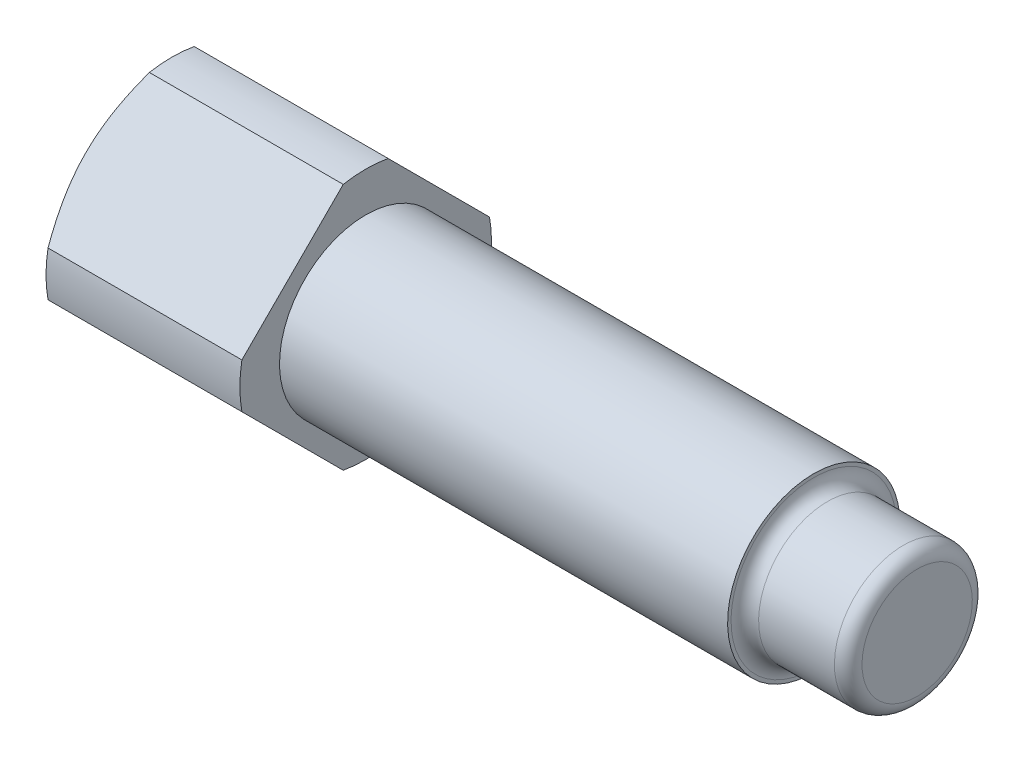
ISO-10303-21;
HEADER;
FILE_DESCRIPTION(('STEP AP214'),'2;1');
FILE_NAME('part.step','',(''),(''),'','','');
FILE_SCHEMA(('AUTOMOTIVE_DESIGN { 1 0 10303 214 1 1 1 1 }'));
ENDSEC;
DATA;
#1=APPLICATION_CONTEXT('core data for automotive mechanical design processes');
#2=APPLICATION_PROTOCOL_DEFINITION('international standard','automotive_design',2000,#1);
#3=PRODUCT_CONTEXT('',#1,'mechanical');
#4=PRODUCT('Part','Part','',(#3));
#5=PRODUCT_RELATED_PRODUCT_CATEGORY('part','',(#4));
#6=PRODUCT_DEFINITION_FORMATION('','',#4);
#7=PRODUCT_DEFINITION_CONTEXT('part definition',#1,'design');
#8=PRODUCT_DEFINITION('design','',#6,#7);
#9=PRODUCT_DEFINITION_SHAPE('','',#8);
#10=(LENGTH_UNIT() NAMED_UNIT(*) SI_UNIT(.MILLI.,.METRE.));
#11=(NAMED_UNIT(*) PLANE_ANGLE_UNIT() SI_UNIT($,.RADIAN.));
#12=(NAMED_UNIT(*) SI_UNIT($,.STERADIAN.) SOLID_ANGLE_UNIT());
#13=UNCERTAINTY_MEASURE_WITH_UNIT(LENGTH_MEASURE(1.E-05),#10,'distance_accuracy_value','');
#14=(GEOMETRIC_REPRESENTATION_CONTEXT(3) GLOBAL_UNCERTAINTY_ASSIGNED_CONTEXT((#13)) GLOBAL_UNIT_ASSIGNED_CONTEXT((#10,
#11,#12)) REPRESENTATION_CONTEXT('',''));
#15=CARTESIAN_POINT('',(0.,0.,0.));
#16=DIRECTION('',(0.,0.,1.));
#17=DIRECTION('',(1.,0.,0.));
#18=AXIS2_PLACEMENT_3D('',#15,#16,#17);
#19=CARTESIAN_POINT('',(6.,0.,0.));
#20=DIRECTION('',(1.,0.,0.));
#21=DIRECTION('',(0.,0.,-1.));
#22=AXIS2_PLACEMENT_3D('',#19,#20,#21);
#23=PLANE('',#22);
#24=CARTESIAN_POINT('',(6.,0.,0.));
#25=DIRECTION('',(1.,0.,0.));
#26=DIRECTION('',(0.,0.,-1.));
#27=AXIS2_PLACEMENT_3D('',#24,#25,#26);
#28=CIRCLE('',#27,3.65);
#29=CARTESIAN_POINT('',(5.99999999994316,0.651201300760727,3.59143938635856));
#30=VERTEX_POINT('',#29);
#31=CARTESIAN_POINT('',(5.99999999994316,-0.651201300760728,3.59143938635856));
#32=VERTEX_POINT('',#31);
#33=EDGE_CURVE('E243',#30,#32,#28,.T.);
#34=ORIENTED_EDGE('',*,*,#33,.T.);
#35=DIRECTION('',(0.,0.707106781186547,0.707106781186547));
#36=VECTOR('',#35,1.);
#37=CARTESIAN_POINT('',(5.99999999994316,-4.24264068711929,0.));
#38=LINE('',#37,#36);
#39=CARTESIAN_POINT('',(5.99999999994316,-3.59143938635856,0.651201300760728));
#40=VERTEX_POINT('',#39);
#41=EDGE_CURVE('E279',#40,#32,#38,.T.);
#42=ORIENTED_EDGE('',*,*,#41,.F.);
#43=CARTESIAN_POINT('',(5.99999999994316,-3.59143938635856,-0.651201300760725));
#44=VERTEX_POINT('',#43);
#45=EDGE_CURVE('E249',#40,#44,#28,.T.);
#46=ORIENTED_EDGE('',*,*,#45,.T.);
#47=DIRECTION('',(0.,-0.707106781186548,0.707106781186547));
#48=VECTOR('',#47,1.);
#49=CARTESIAN_POINT('',(5.99999999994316,0.,-4.24264068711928));
#50=LINE('',#49,#48);
#51=CARTESIAN_POINT('',(5.99999999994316,-0.651201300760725,-3.59143938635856));
#52=VERTEX_POINT('',#51);
#53=EDGE_CURVE('E274',#52,#44,#50,.T.);
#54=ORIENTED_EDGE('',*,*,#53,.F.);
#55=CARTESIAN_POINT('',(5.99999999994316,0.651201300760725,-3.59143938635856));
#56=VERTEX_POINT('',#55);
#57=EDGE_CURVE('E244',#52,#56,#28,.T.);
#58=ORIENTED_EDGE('',*,*,#57,.T.);
#59=DIRECTION('',(0.,-0.707106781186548,-0.707106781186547));
#60=VECTOR('',#59,1.);
#61=CARTESIAN_POINT('',(5.99999999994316,4.24264068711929,0.));
#62=LINE('',#61,#60);
#63=CARTESIAN_POINT('',(5.99999999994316,3.59143938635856,-0.651201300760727));
#64=VERTEX_POINT('',#63);
#65=EDGE_CURVE('E276',#64,#56,#62,.T.);
#66=ORIENTED_EDGE('',*,*,#65,.F.);
#67=CARTESIAN_POINT('',(5.99999999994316,3.59143938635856,0.651201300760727));
#68=VERTEX_POINT('',#67);
#69=EDGE_CURVE('E241',#64,#68,#28,.T.);
#70=ORIENTED_EDGE('',*,*,#69,.T.);
#71=DIRECTION('',(0.,0.707106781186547,-0.707106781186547));
#72=VECTOR('',#71,1.);
#73=CARTESIAN_POINT('',(5.99999999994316,0.,4.24264068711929));
#74=LINE('',#73,#72);
#75=EDGE_CURVE('E278',#30,#68,#74,.T.);
#76=ORIENTED_EDGE('',*,*,#75,.F.);
#77=EDGE_LOOP('',(#34,#42,#46,#54,#58,#66,#70,#76));
#78=FACE_BOUND('',#77,.T.);
#79=CARTESIAN_POINT('',(5.99999999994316,0.,0.));
#80=DIRECTION('',(1.,0.,0.));
#81=DIRECTION('',(0.,1.,0.));
#82=AXIS2_PLACEMENT_3D('',#79,#80,#81);
#83=CIRCLE('',#82,2.5);
#84=CARTESIAN_POINT('',(5.99999999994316,2.5,0.));
#85=VERTEX_POINT('',#84);
#86=EDGE_CURVE('E127',#85,#85,#83,.T.);
#87=ORIENTED_EDGE('',*,*,#86,.F.);
#88=EDGE_LOOP('',(#87));
#89=FACE_BOUND('',#88,.T.);
#90=ADVANCED_FACE('F38',(#78,#89),#23,.T.);
#91=CARTESIAN_POINT('',(6.,0.,0.));
#92=DIRECTION('',(-1.,0.,0.));
#93=DIRECTION('',(0.,0.,1.));
#94=AXIS2_PLACEMENT_3D('',#91,#92,#93);
#95=CYLINDRICAL_SURFACE('',#94,3.65);
#96=DIRECTION('',(-1.,0.,0.));
#97=VECTOR('',#96,1.);
#98=CARTESIAN_POINT('',(6.,0.651201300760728,3.59143938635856));
#99=LINE('',#98,#97);
#100=CARTESIAN_POINT('',(0.375277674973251,0.651201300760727,3.59143938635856));
#101=VERTEX_POINT('',#100);
#102=EDGE_CURVE('E272',#101,#30,#99,.F.);
#103=ORIENTED_EDGE('',*,*,#102,.F.);
#104=CARTESIAN_POINT('',(0.375277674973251,0.,0.));
#105=DIRECTION('',(1.,0.,0.));
#106=DIRECTION('',(0.,1.,0.));
#107=AXIS2_PLACEMENT_3D('',#104,#105,#106);
#108=CIRCLE('',#107,3.65);
#109=CARTESIAN_POINT('',(0.375277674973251,-0.651201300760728,3.59143938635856));
#110=VERTEX_POINT('',#109);
#111=EDGE_CURVE('E136',#101,#110,#108,.T.);
#112=ORIENTED_EDGE('',*,*,#111,.T.);
#113=DIRECTION('',(-1.,0.,0.));
#114=VECTOR('',#113,1.);
#115=CARTESIAN_POINT('',(6.,-0.651201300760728,3.59143938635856));
#116=LINE('',#115,#114);
#117=EDGE_CURVE('E252',#32,#110,#116,.T.);
#118=ORIENTED_EDGE('',*,*,#117,.F.);
#119=ORIENTED_EDGE('',*,*,#33,.F.);
#120=EDGE_LOOP('',(#103,#112,#118,#119));
#121=FACE_BOUND('',#120,.T.);
#122=ADVANCED_FACE('F210',(#121),#95,.T.);
#123=DIRECTION('',(-1.,0.,0.));
#124=VECTOR('',#123,1.);
#125=CARTESIAN_POINT('',(6.,-3.59143938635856,0.651201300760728));
#126=LINE('',#125,#124);
#127=CARTESIAN_POINT('',(0.375277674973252,-3.59143938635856,0.651201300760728));
#128=VERTEX_POINT('',#127);
#129=EDGE_CURVE('E257',#128,#40,#126,.F.);
#130=ORIENTED_EDGE('',*,*,#129,.F.);
#131=CARTESIAN_POINT('',(0.375277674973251,0.,0.));
#132=DIRECTION('',(1.,0.,0.));
#133=DIRECTION('',(0.,1.,0.));
#134=AXIS2_PLACEMENT_3D('',#131,#132,#133);
#135=CIRCLE('',#134,3.65);
#136=CARTESIAN_POINT('',(0.375277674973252,-3.59143938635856,-0.651201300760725));
#137=VERTEX_POINT('',#136);
#138=EDGE_CURVE('E150',#128,#137,#135,.T.);
#139=ORIENTED_EDGE('',*,*,#138,.T.);
#140=DIRECTION('',(-1.,0.,0.));
#141=VECTOR('',#140,1.);
#142=CARTESIAN_POINT('',(6.,-3.59143938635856,-0.651201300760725));
#143=LINE('',#142,#141);
#144=EDGE_CURVE('E259',#44,#137,#143,.T.);
#145=ORIENTED_EDGE('',*,*,#144,.F.);
#146=ORIENTED_EDGE('',*,*,#45,.F.);
#147=EDGE_LOOP('',(#130,#139,#145,#146));
#148=FACE_BOUND('',#147,.T.);
#149=ADVANCED_FACE('F215',(#148),#95,.T.);
#150=DIRECTION('',(-1.,0.,0.));
#151=VECTOR('',#150,1.);
#152=CARTESIAN_POINT('',(6.,-0.651201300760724,-3.59143938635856));
#153=LINE('',#152,#151);
#154=CARTESIAN_POINT('',(0.375277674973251,-0.651201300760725,-3.59143938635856));
#155=VERTEX_POINT('',#154);
#156=EDGE_CURVE('E264',#155,#52,#153,.F.);
#157=ORIENTED_EDGE('',*,*,#156,.F.);
#158=CARTESIAN_POINT('',(0.375277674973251,0.,0.));
#159=DIRECTION('',(1.,0.,0.));
#160=DIRECTION('',(0.,1.,0.));
#161=AXIS2_PLACEMENT_3D('',#158,#159,#160);
#162=CIRCLE('',#161,3.65);
#163=CARTESIAN_POINT('',(0.375277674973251,0.651201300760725,-3.59143938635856));
#164=VERTEX_POINT('',#163);
#165=EDGE_CURVE('E139',#155,#164,#162,.T.);
#166=ORIENTED_EDGE('',*,*,#165,.T.);
#167=DIRECTION('',(-1.,0.,0.));
#168=VECTOR('',#167,1.);
#169=CARTESIAN_POINT('',(6.,0.651201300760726,-3.59143938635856));
#170=LINE('',#169,#168);
#171=EDGE_CURVE('E266',#56,#164,#170,.T.);
#172=ORIENTED_EDGE('',*,*,#171,.F.);
#173=ORIENTED_EDGE('',*,*,#57,.F.);
#174=EDGE_LOOP('',(#157,#166,#172,#173));
#175=FACE_BOUND('',#174,.T.);
#176=ADVANCED_FACE('F288',(#175),#95,.T.);
#177=DIRECTION('',(-1.,0.,0.));
#178=VECTOR('',#177,1.);
#179=CARTESIAN_POINT('',(6.,3.59143938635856,-0.651201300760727));
#180=LINE('',#179,#178);
#181=CARTESIAN_POINT('',(0.375277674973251,3.59143938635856,-0.651201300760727));
#182=VERTEX_POINT('',#181);
#183=EDGE_CURVE('E269',#182,#64,#180,.F.);
#184=ORIENTED_EDGE('',*,*,#183,.F.);
#185=CARTESIAN_POINT('',(0.375277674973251,0.,0.));
#186=DIRECTION('',(1.,0.,0.));
#187=DIRECTION('',(0.,1.,0.));
#188=AXIS2_PLACEMENT_3D('',#185,#186,#187);
#189=CIRCLE('',#188,3.65);
#190=CARTESIAN_POINT('',(0.375277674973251,3.59143938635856,0.651201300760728));
#191=VERTEX_POINT('',#190);
#192=EDGE_CURVE('E146',#182,#191,#189,.T.);
#193=ORIENTED_EDGE('',*,*,#192,.T.);
#194=DIRECTION('',(-1.,0.,0.));
#195=VECTOR('',#194,1.);
#196=CARTESIAN_POINT('',(6.,3.59143938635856,0.651201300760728));
#197=LINE('',#196,#195);
#198=EDGE_CURVE('E145',#68,#191,#197,.T.);
#199=ORIENTED_EDGE('',*,*,#198,.F.);
#200=ORIENTED_EDGE('',*,*,#69,.F.);
#201=EDGE_LOOP('',(#184,#193,#199,#200));
#202=FACE_BOUND('',#201,.T.);
#203=ADVANCED_FACE('F202',(#202),#95,.T.);
#204=CARTESIAN_POINT('',(5.99999999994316,0.,4.24264068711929));
#205=DIRECTION('',(0.,0.707106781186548,0.707106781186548));
#206=DIRECTION('',(0.,-0.707106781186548,0.707106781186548));
#207=AXIS2_PLACEMENT_3D('',#204,#205,#206);
#208=PLANE('',#207);
#209=CARTESIAN_POINT('',(0.375370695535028,0.651001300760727,3.59163938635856));
#210=CARTESIAN_POINT('',(0.323268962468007,0.76312079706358,3.47951989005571));
#211=CARTESIAN_POINT('',(0.274661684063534,0.876174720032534,3.36646596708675));
#212=CARTESIAN_POINT('',(0.18690962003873,1.10452820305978,3.13811248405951));
#213=CARTESIAN_POINT('',(0.147799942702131,1.21983444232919,3.0228062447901));
#214=CARTESIAN_POINT('',(0.0829033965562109,1.44883414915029,2.79380653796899));
#215=CARTESIAN_POINT('',(0.0567585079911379,1.56247530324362,2.68016538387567));
#216=CARTESIAN_POINT('',(0.0185374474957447,1.79078192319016,2.45185876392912));
#217=CARTESIAN_POINT('',(0.00643659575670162,1.90544523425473,2.33719545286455));
#218=CARTESIAN_POINT('',(-0.000588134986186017,2.08579182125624,2.15684886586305));
#219=CARTESIAN_POINT('',(-0.000652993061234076,2.15139124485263,2.09124944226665));
#220=CARTESIAN_POINT('',(0.00417098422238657,2.28250476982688,1.9601359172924));
#221=CARTESIAN_POINT('',(0.00906003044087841,2.34801886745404,1.89462181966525));
#222=CARTESIAN_POINT('',(0.0236362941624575,2.4789109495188,1.76372973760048));
#223=CARTESIAN_POINT('',(0.0333332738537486,2.54428838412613,1.69835230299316));
#224=CARTESIAN_POINT('',(0.0571990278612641,2.67463782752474,1.56800285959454));
#225=CARTESIAN_POINT('',(0.0713685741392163,2.73960976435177,1.50303092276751));
#226=CARTESIAN_POINT('',(0.121061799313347,2.93818256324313,1.30445812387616));
#227=CARTESIAN_POINT('',(0.1632291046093,3.07096692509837,1.17167376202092));
#228=CARTESIAN_POINT('',(0.2362538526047,3.26794686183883,0.974693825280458));
#229=CARTESIAN_POINT('',(0.262163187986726,3.3331132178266,0.909527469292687));
#230=CARTESIAN_POINT('',(0.316779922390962,3.46282259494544,0.77981809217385));
#231=CARTESIAN_POINT('',(0.345485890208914,3.52736591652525,0.715274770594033));
#232=CARTESIAN_POINT('',(0.375370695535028,3.59163938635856,0.651001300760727));
#233=B_SPLINE_CURVE_WITH_KNOTS('',3,(#209,#210,#211,#212,#213,#214,#215,#216,#217,#218,#219,
#220,#221,#222,#223,#224,#225,#226,#227,#228,#229,#230,#231,#232),.UNSPECIFIED.,.F.,.F.,(4,2,2,
2,2,2,2,2,2,2,2,4),(0.,0.500916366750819,1.0036571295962,1.49161120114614,1.97870647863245,
2.25690162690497,2.53510861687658,2.81388281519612,3.09270515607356,3.66932423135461,
3.95649300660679,4.24351558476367),.UNSPECIFIED.);
#234=CARTESIAN_POINT('',(0.,2.12132034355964,2.12132034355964));
#235=VERTEX_POINT('',#234);
#236=EDGE_CURVE('E132',#101,#235,#233,.T.);
#237=ORIENTED_EDGE('',*,*,#236,.F.);
#238=ORIENTED_EDGE('',*,*,#102,.T.);
#239=ORIENTED_EDGE('',*,*,#75,.T.);
#240=ORIENTED_EDGE('',*,*,#198,.T.);
#241=EDGE_CURVE('E120',#235,#191,#233,.T.);
#242=ORIENTED_EDGE('',*,*,#241,.F.);
#243=EDGE_LOOP('',(#237,#238,#239,#240,#242));
#244=FACE_BOUND('',#243,.T.);
#245=ADVANCED_FACE('F143',(#244),#208,.T.);
#246=CARTESIAN_POINT('',(5.99999999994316,4.24264068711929,0.));
#247=DIRECTION('',(0.,0.707106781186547,-0.707106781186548));
#248=DIRECTION('',(0.,0.707106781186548,0.707106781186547));
#249=AXIS2_PLACEMENT_3D('',#246,#247,#248);
#250=PLANE('',#249);
#251=CARTESIAN_POINT('',(0.375370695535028,3.59163938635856,-0.651001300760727));
#252=CARTESIAN_POINT('',(0.323268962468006,3.47951989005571,-0.76312079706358));
#253=CARTESIAN_POINT('',(0.274661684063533,3.36646596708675,-0.876174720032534));
#254=CARTESIAN_POINT('',(0.18690962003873,3.13811248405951,-1.10452820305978));
#255=CARTESIAN_POINT('',(0.14779994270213,3.0228062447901,-1.21983444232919));
#256=CARTESIAN_POINT('',(0.0829033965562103,2.79380653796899,-1.44883414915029));
#257=CARTESIAN_POINT('',(0.0567585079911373,2.68016538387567,-1.56247530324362));
#258=CARTESIAN_POINT('',(0.0185374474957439,2.45185876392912,-1.79078192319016));
#259=CARTESIAN_POINT('',(0.00643659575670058,2.33719545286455,-1.90544523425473));
#260=CARTESIAN_POINT('',(-0.000588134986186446,2.15684886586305,-2.08579182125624));
#261=CARTESIAN_POINT('',(-0.000652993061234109,2.09124944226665,-2.15139124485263));
#262=CARTESIAN_POINT('',(0.00417098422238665,1.9601359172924,-2.28250476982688));
#263=CARTESIAN_POINT('',(0.0090600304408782,1.89462181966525,-2.34801886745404));
#264=CARTESIAN_POINT('',(0.0236362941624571,1.76372973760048,-2.4789109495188));
#265=CARTESIAN_POINT('',(0.0333332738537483,1.69835230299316,-2.54428838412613));
#266=CARTESIAN_POINT('',(0.0571990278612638,1.56800285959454,-2.67463782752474));
#267=CARTESIAN_POINT('',(0.071368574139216,1.50303092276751,-2.73960976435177));
#268=CARTESIAN_POINT('',(0.121061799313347,1.30445812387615,-2.93818256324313));
#269=CARTESIAN_POINT('',(0.1632291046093,1.17167376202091,-3.07096692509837));
#270=CARTESIAN_POINT('',(0.2362538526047,0.974693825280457,-3.26794686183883));
#271=CARTESIAN_POINT('',(0.262163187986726,0.909527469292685,-3.3331132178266));
#272=CARTESIAN_POINT('',(0.316779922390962,0.779818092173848,-3.46282259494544));
#273=CARTESIAN_POINT('',(0.345485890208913,0.715274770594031,-3.52736591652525));
#274=CARTESIAN_POINT('',(0.375370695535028,0.651001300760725,-3.59163938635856));
#275=B_SPLINE_CURVE_WITH_KNOTS('',3,(#251,#252,#253,#254,#255,#256,#257,#258,#259,#260,#261,
#262,#263,#264,#265,#266,#267,#268,#269,#270,#271,#272,#273,#274),.UNSPECIFIED.,.F.,.F.,(4,2,2,
2,2,2,2,2,2,2,2,4),(0.,0.500916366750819,1.0036571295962,1.49161120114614,1.97870647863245,
2.25690162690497,2.53510861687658,2.81388281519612,3.09270515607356,3.66932423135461,
3.95649300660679,4.24351558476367),.UNSPECIFIED.);
#276=CARTESIAN_POINT('',(0.,2.12132034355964,-2.12132034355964));
#277=VERTEX_POINT('',#276);
#278=EDGE_CURVE('E123',#182,#277,#275,.T.);
#279=ORIENTED_EDGE('',*,*,#278,.F.);
#280=ORIENTED_EDGE('',*,*,#183,.T.);
#281=ORIENTED_EDGE('',*,*,#65,.T.);
#282=ORIENTED_EDGE('',*,*,#171,.T.);
#283=EDGE_CURVE('E190',#277,#164,#275,.T.);
#284=ORIENTED_EDGE('',*,*,#283,.F.);
#285=EDGE_LOOP('',(#279,#280,#281,#282,#284));
#286=FACE_BOUND('',#285,.T.);
#287=ADVANCED_FACE('F196',(#286),#250,.T.);
#288=CARTESIAN_POINT('',(5.99999999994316,0.,-4.24264068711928));
#289=DIRECTION('',(0.,-0.707106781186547,-0.707106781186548));
#290=DIRECTION('',(0.,0.707106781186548,-0.707106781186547));
#291=AXIS2_PLACEMENT_3D('',#288,#289,#290);
#292=PLANE('',#291);
#293=CARTESIAN_POINT('',(0.375370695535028,-0.651001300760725,-3.59163938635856));
#294=CARTESIAN_POINT('',(0.323268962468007,-0.763120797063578,-3.4795198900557));
#295=CARTESIAN_POINT('',(0.274661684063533,-0.876174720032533,-3.36646596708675));
#296=CARTESIAN_POINT('',(0.18690962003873,-1.10452820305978,-3.13811248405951));
#297=CARTESIAN_POINT('',(0.14779994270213,-1.21983444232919,-3.0228062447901));
#298=CARTESIAN_POINT('',(0.0829033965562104,-1.44883414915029,-2.79380653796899));
#299=CARTESIAN_POINT('',(0.0567585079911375,-1.56247530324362,-2.68016538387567));
#300=CARTESIAN_POINT('',(0.0185374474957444,-1.79078192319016,-2.45185876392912));
#301=CARTESIAN_POINT('',(0.00643659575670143,-1.90544523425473,-2.33719545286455));
#302=CARTESIAN_POINT('',(-0.000588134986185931,-2.08579182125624,-2.15684886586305));
#303=CARTESIAN_POINT('',(-0.000652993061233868,-2.15139124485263,-2.09124944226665));
#304=CARTESIAN_POINT('',(0.00417098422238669,-2.28250476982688,-1.9601359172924));
#305=CARTESIAN_POINT('',(0.00906003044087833,-2.34801886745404,-1.89462181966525));
#306=CARTESIAN_POINT('',(0.0236362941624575,-2.4789109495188,-1.76372973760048));
#307=CARTESIAN_POINT('',(0.0333332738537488,-2.54428838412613,-1.69835230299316));
#308=CARTESIAN_POINT('',(0.0571990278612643,-2.67463782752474,-1.56800285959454));
#309=CARTESIAN_POINT('',(0.0713685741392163,-2.73960976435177,-1.50303092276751));
#310=CARTESIAN_POINT('',(0.121061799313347,-2.93818256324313,-1.30445812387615));
#311=CARTESIAN_POINT('',(0.163229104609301,-3.07096692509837,-1.17167376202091));
#312=CARTESIAN_POINT('',(0.236253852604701,-3.26794686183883,-0.974693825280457));
#313=CARTESIAN_POINT('',(0.262163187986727,-3.3331132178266,-0.909527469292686));
#314=CARTESIAN_POINT('',(0.316779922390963,-3.46282259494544,-0.779818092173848));
#315=CARTESIAN_POINT('',(0.345485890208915,-3.52736591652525,-0.715274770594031));
#316=CARTESIAN_POINT('',(0.375370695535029,-3.59163938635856,-0.651001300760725));
#317=B_SPLINE_CURVE_WITH_KNOTS('',3,(#293,#294,#295,#296,#297,#298,#299,#300,#301,#302,#303,
#304,#305,#306,#307,#308,#309,#310,#311,#312,#313,#314,#315,#316),.UNSPECIFIED.,.F.,.F.,(4,2,2,
2,2,2,2,2,2,2,2,4),(0.,0.50091636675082,1.0036571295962,1.49161120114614,1.97870647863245,
2.25690162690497,2.53510861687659,2.81388281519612,3.09270515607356,3.66932423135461,
3.95649300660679,4.24351558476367),.UNSPECIFIED.);
#318=CARTESIAN_POINT('',(0.,-2.12132034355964,-2.12132034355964));
#319=VERTEX_POINT('',#318);
#320=EDGE_CURVE('E140',#155,#319,#317,.T.);
#321=ORIENTED_EDGE('',*,*,#320,.F.);
#322=ORIENTED_EDGE('',*,*,#156,.T.);
#323=ORIENTED_EDGE('',*,*,#53,.T.);
#324=ORIENTED_EDGE('',*,*,#144,.T.);
#325=EDGE_CURVE('E157',#319,#137,#317,.T.);
#326=ORIENTED_EDGE('',*,*,#325,.F.);
#327=EDGE_LOOP('',(#321,#322,#323,#324,#326));
#328=FACE_BOUND('',#327,.T.);
#329=ADVANCED_FACE('F168',(#328),#292,.T.);
#330=CARTESIAN_POINT('',(5.99999999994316,-4.24264068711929,0.));
#331=DIRECTION('',(0.,-0.707106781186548,0.707106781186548));
#332=DIRECTION('',(0.,-0.707106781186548,-0.707106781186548));
#333=AXIS2_PLACEMENT_3D('',#330,#331,#332);
#334=PLANE('',#333);
#335=CARTESIAN_POINT('',(0.375370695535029,-3.59163938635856,0.651001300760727));
#336=CARTESIAN_POINT('',(0.323268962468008,-3.47951989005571,0.763120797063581));
#337=CARTESIAN_POINT('',(0.274661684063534,-3.36646596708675,0.876174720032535));
#338=CARTESIAN_POINT('',(0.186909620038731,-3.13811248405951,1.10452820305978));
#339=CARTESIAN_POINT('',(0.147799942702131,-3.0228062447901,1.21983444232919));
#340=CARTESIAN_POINT('',(0.0829033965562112,-2.79380653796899,1.4488341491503));
#341=CARTESIAN_POINT('',(0.0567585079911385,-2.68016538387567,1.56247530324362));
#342=CARTESIAN_POINT('',(0.0185374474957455,-2.45185876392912,1.79078192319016));
#343=CARTESIAN_POINT('',(0.00643659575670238,-2.33719545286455,1.90544523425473));
#344=CARTESIAN_POINT('',(-0.000588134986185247,-2.15684886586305,2.08579182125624));
#345=CARTESIAN_POINT('',(-0.000652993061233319,-2.09124944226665,2.15139124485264));
#346=CARTESIAN_POINT('',(0.00417098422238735,-1.9601359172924,2.28250476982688));
#347=CARTESIAN_POINT('',(0.00906003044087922,-1.89462181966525,2.34801886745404));
#348=CARTESIAN_POINT('',(0.0236362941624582,-1.76372973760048,2.4789109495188));
#349=CARTESIAN_POINT('',(0.0333332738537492,-1.69835230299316,2.54428838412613));
#350=CARTESIAN_POINT('',(0.0571990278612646,-1.56800285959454,2.67463782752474));
#351=CARTESIAN_POINT('',(0.0713685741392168,-1.50303092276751,2.73960976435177));
#352=CARTESIAN_POINT('',(0.121061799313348,-1.30445812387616,2.93818256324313));
#353=CARTESIAN_POINT('',(0.1632291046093,-1.17167376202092,3.07096692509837));
#354=CARTESIAN_POINT('',(0.2362538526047,-0.974693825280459,3.26794686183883));
#355=CARTESIAN_POINT('',(0.262163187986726,-0.909527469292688,3.3331132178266));
#356=CARTESIAN_POINT('',(0.316779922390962,-0.779818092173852,3.46282259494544));
#357=CARTESIAN_POINT('',(0.345485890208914,-0.715274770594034,3.52736591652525));
#358=CARTESIAN_POINT('',(0.375370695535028,-0.651001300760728,3.59163938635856));
#359=B_SPLINE_CURVE_WITH_KNOTS('',3,(#335,#336,#337,#338,#339,#340,#341,#342,#343,#344,#345,
#346,#347,#348,#349,#350,#351,#352,#353,#354,#355,#356,#357,#358),.UNSPECIFIED.,.F.,.F.,(4,2,2,
2,2,2,2,2,2,2,2,4),(0.,0.500916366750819,1.0036571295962,1.49161120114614,1.97870647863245,
2.25690162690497,2.53510861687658,2.81388281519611,3.09270515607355,3.66932423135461,
3.95649300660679,4.24351558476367),.UNSPECIFIED.);
#360=CARTESIAN_POINT('',(0.,-2.12132034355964,2.12132034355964));
#361=VERTEX_POINT('',#360);
#362=EDGE_CURVE('E61',#128,#361,#359,.T.);
#363=ORIENTED_EDGE('',*,*,#362,.F.);
#364=ORIENTED_EDGE('',*,*,#129,.T.);
#365=ORIENTED_EDGE('',*,*,#41,.T.);
#366=ORIENTED_EDGE('',*,*,#117,.T.);
#367=EDGE_CURVE('E181',#361,#110,#359,.T.);
#368=ORIENTED_EDGE('',*,*,#367,.F.);
#369=EDGE_LOOP('',(#363,#364,#365,#366,#368));
#370=FACE_BOUND('',#369,.T.);
#371=ADVANCED_FACE('F203',(#370),#334,.T.);
#372=CARTESIAN_POINT('',(0.,0.,0.));
#373=DIRECTION('',(1.,0.,0.));
#374=DIRECTION('',(0.,1.,0.));
#375=AXIS2_PLACEMENT_3D('',#372,#373,#374);
#376=CONICAL_SURFACE('',#375,3.,1.0471975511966);
#377=ORIENTED_EDGE('',*,*,#236,.T.);
#378=CARTESIAN_POINT('',(0.,0.,0.));
#379=DIRECTION('',(1.,0.,0.));
#380=DIRECTION('',(0.,1.,0.));
#381=AXIS2_PLACEMENT_3D('',#378,#379,#380);
#382=CIRCLE('',#381,3.);
#383=EDGE_CURVE('E129',#235,#361,#382,.T.);
#384=ORIENTED_EDGE('',*,*,#383,.T.);
#385=ORIENTED_EDGE('',*,*,#367,.T.);
#386=ORIENTED_EDGE('',*,*,#111,.F.);
#387=EDGE_LOOP('',(#377,#384,#385,#386));
#388=FACE_BOUND('',#387,.T.);
#389=ADVANCED_FACE('F133',(#388),#376,.T.);
#390=ORIENTED_EDGE('',*,*,#325,.T.);
#391=ORIENTED_EDGE('',*,*,#138,.F.);
#392=ORIENTED_EDGE('',*,*,#362,.T.);
#393=EDGE_CURVE('E149',#361,#319,#382,.T.);
#394=ORIENTED_EDGE('',*,*,#393,.T.);
#395=EDGE_LOOP('',(#390,#391,#392,#394));
#396=FACE_BOUND('',#395,.T.);
#397=ADVANCED_FACE('F171',(#396),#376,.T.);
#398=ORIENTED_EDGE('',*,*,#283,.T.);
#399=ORIENTED_EDGE('',*,*,#165,.F.);
#400=ORIENTED_EDGE('',*,*,#320,.T.);
#401=EDGE_CURVE('E53',#319,#277,#382,.T.);
#402=ORIENTED_EDGE('',*,*,#401,.T.);
#403=EDGE_LOOP('',(#398,#399,#400,#402));
#404=FACE_BOUND('',#403,.T.);
#405=ADVANCED_FACE('F175',(#404),#376,.T.);
#406=ORIENTED_EDGE('',*,*,#278,.T.);
#407=EDGE_CURVE('E116',#277,#235,#382,.T.);
#408=ORIENTED_EDGE('',*,*,#407,.T.);
#409=ORIENTED_EDGE('',*,*,#241,.T.);
#410=ORIENTED_EDGE('',*,*,#192,.F.);
#411=EDGE_LOOP('',(#406,#408,#409,#410));
#412=FACE_BOUND('',#411,.T.);
#413=ADVANCED_FACE('F118',(#412),#376,.T.);
#414=CARTESIAN_POINT('',(0.,0.,0.));
#415=DIRECTION('',(1.,0.,0.));
#416=DIRECTION('',(0.,0.,-1.));
#417=AXIS2_PLACEMENT_3D('',#414,#415,#416);
#418=PLANE('',#417);
#419=ORIENTED_EDGE('',*,*,#401,.F.);
#420=ORIENTED_EDGE('',*,*,#393,.F.);
#421=ORIENTED_EDGE('',*,*,#383,.F.);
#422=ORIENTED_EDGE('',*,*,#407,.F.);
#423=EDGE_LOOP('',(#419,#420,#421,#422));
#424=FACE_BOUND('',#423,.T.);
#425=ADVANCED_FACE('F148',(#424),#418,.F.);
#426=CARTESIAN_POINT('',(6.5663832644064,0.,0.));
#427=DIRECTION('',(1.,0.,0.));
#428=DIRECTION('',(0.,1.,0.));
#429=AXIS2_PLACEMENT_3D('',#426,#427,#428);
#430=CYLINDRICAL_SURFACE('',#429,2.5);
#431=CARTESIAN_POINT('',(18.9999999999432,0.,0.));
#432=DIRECTION('',(1.,0.,0.));
#433=DIRECTION('',(0.,1.,0.));
#434=AXIS2_PLACEMENT_3D('',#431,#432,#433);
#435=CIRCLE('',#434,2.5);
#436=CARTESIAN_POINT('',(18.9999999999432,2.50000000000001,0.));
#437=VERTEX_POINT('',#436);
#438=EDGE_CURVE('E434',#437,#437,#435,.T.);
#439=ORIENTED_EDGE('',*,*,#438,.F.);
#440=EDGE_LOOP('',(#439));
#441=FACE_BOUND('',#440,.T.);
#442=ORIENTED_EDGE('',*,*,#86,.T.);
#443=EDGE_LOOP('',(#442));
#444=FACE_BOUND('',#443,.T.);
#445=ADVANCED_FACE('F176',(#441,#444),#430,.T.);
#446=CARTESIAN_POINT('',(18.9999999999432,-2.5,0.));
#447=DIRECTION('',(-1.,0.,0.));
#448=DIRECTION('',(0.,-1.,0.));
#449=AXIS2_PLACEMENT_3D('',#446,#447,#448);
#450=PLANE('',#449);
#451=CARTESIAN_POINT('',(18.9999999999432,0.,0.));
#452=DIRECTION('',(-1.,0.,0.));
#453=DIRECTION('',(0.,-1.,0.));
#454=AXIS2_PLACEMENT_3D('',#451,#452,#453);
#455=CIRCLE('',#454,2.4);
#456=CARTESIAN_POINT('',(18.9999999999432,-2.4,0.));
#457=VERTEX_POINT('',#456);
#458=EDGE_CURVE('E46',#457,#457,#455,.T.);
#459=ORIENTED_EDGE('',*,*,#458,.T.);
#460=EDGE_LOOP('',(#459));
#461=FACE_BOUND('',#460,.T.);
#462=ORIENTED_EDGE('',*,*,#438,.T.);
#463=EDGE_LOOP('',(#462));
#464=FACE_BOUND('',#463,.T.);
#465=ADVANCED_FACE('F351',(#461,#464),#450,.F.);
#466=CARTESIAN_POINT('',(6.5663832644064,0.,0.));
#467=DIRECTION('',(1.,0.,0.));
#468=DIRECTION('',(0.,1.,0.));
#469=AXIS2_PLACEMENT_3D('',#466,#467,#468);
#470=CYLINDRICAL_SURFACE('',#469,2.);
#471=CARTESIAN_POINT('',(19.3999999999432,0.,0.));
#472=DIRECTION('',(-1.,0.,0.));
#473=DIRECTION('',(0.,-1.,0.));
#474=AXIS2_PLACEMENT_3D('',#471,#472,#473);
#475=CIRCLE('',#474,2.);
#476=CARTESIAN_POINT('',(19.3999999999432,-2.,0.));
#477=VERTEX_POINT('',#476);
#478=EDGE_CURVE('E234',#477,#477,#475,.F.);
#479=ORIENTED_EDGE('',*,*,#478,.T.);
#480=EDGE_LOOP('',(#479));
#481=FACE_BOUND('',#480,.T.);
#482=CARTESIAN_POINT('',(21.5999999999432,0.,0.));
#483=DIRECTION('',(-1.,0.,0.));
#484=DIRECTION('',(0.,-1.,0.));
#485=AXIS2_PLACEMENT_3D('',#482,#483,#484);
#486=CIRCLE('',#485,2.);
#487=CARTESIAN_POINT('',(21.5999999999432,-2.,0.));
#488=VERTEX_POINT('',#487);
#489=EDGE_CURVE('E236',#488,#488,#486,.T.);
#490=ORIENTED_EDGE('',*,*,#489,.T.);
#491=EDGE_LOOP('',(#490));
#492=FACE_BOUND('',#491,.T.);
#493=ADVANCED_FACE('F226',(#481,#492),#470,.T.);
#494=CARTESIAN_POINT('',(21.9999999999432,0.,0.));
#495=DIRECTION('',(-1.,0.,0.));
#496=DIRECTION('',(0.,-1.,0.));
#497=AXIS2_PLACEMENT_3D('',#494,#495,#496);
#498=PLANE('',#497);
#499=CARTESIAN_POINT('',(21.9999999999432,0.,0.));
#500=DIRECTION('',(-1.,0.,0.));
#501=DIRECTION('',(0.,-1.,0.));
#502=AXIS2_PLACEMENT_3D('',#499,#500,#501);
#503=CIRCLE('',#502,1.6);
#504=CARTESIAN_POINT('',(21.9999999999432,-1.6,0.));
#505=VERTEX_POINT('',#504);
#506=EDGE_CURVE('E12',#505,#505,#503,.F.);
#507=ORIENTED_EDGE('',*,*,#506,.T.);
#508=EDGE_LOOP('',(#507));
#509=FACE_BOUND('',#508,.T.);
#510=ADVANCED_FACE('F219',(#509),#498,.F.);
#511=CARTESIAN_POINT('',(19.3999999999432,0.,0.));
#512=DIRECTION('',(-1.,0.,0.));
#513=DIRECTION('',(0.,-1.,0.));
#514=AXIS2_PLACEMENT_3D('',#511,#512,#513);
#515=TOROIDAL_SURFACE('',#514,2.4,0.4);
#516=ORIENTED_EDGE('',*,*,#458,.F.);
#517=EDGE_LOOP('',(#516));
#518=FACE_BOUND('',#517,.T.);
#519=ORIENTED_EDGE('',*,*,#478,.F.);
#520=EDGE_LOOP('',(#519));
#521=FACE_BOUND('',#520,.T.);
#522=ADVANCED_FACE('F217',(#518,#521),#515,.F.);
#523=CARTESIAN_POINT('',(21.5999999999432,0.,0.));
#524=DIRECTION('',(-1.,0.,0.));
#525=DIRECTION('',(0.,-1.,0.));
#526=AXIS2_PLACEMENT_3D('',#523,#524,#525);
#527=TOROIDAL_SURFACE('',#526,1.6,0.4);
#528=ORIENTED_EDGE('',*,*,#489,.F.);
#529=EDGE_LOOP('',(#528));
#530=FACE_BOUND('',#529,.T.);
#531=ORIENTED_EDGE('',*,*,#506,.F.);
#532=EDGE_LOOP('',(#531));
#533=FACE_BOUND('',#532,.T.);
#534=ADVANCED_FACE('F40',(#530,#533),#527,.T.);
#535=CLOSED_SHELL('',(#90,#122,#149,#176,#203,#245,#287,#329,#371,#389,#397,#405,#413,#425,#445,
#465,#493,#510,#522,#534));
#536=MANIFOLD_SOLID_BREP('B2',#535);
#537=ADVANCED_BREP_SHAPE_REPRESENTATION('',(#18,#536),#14);
#538=SHAPE_DEFINITION_REPRESENTATION(#9,#537);
ENDSEC;
END-ISO-10303-21;
